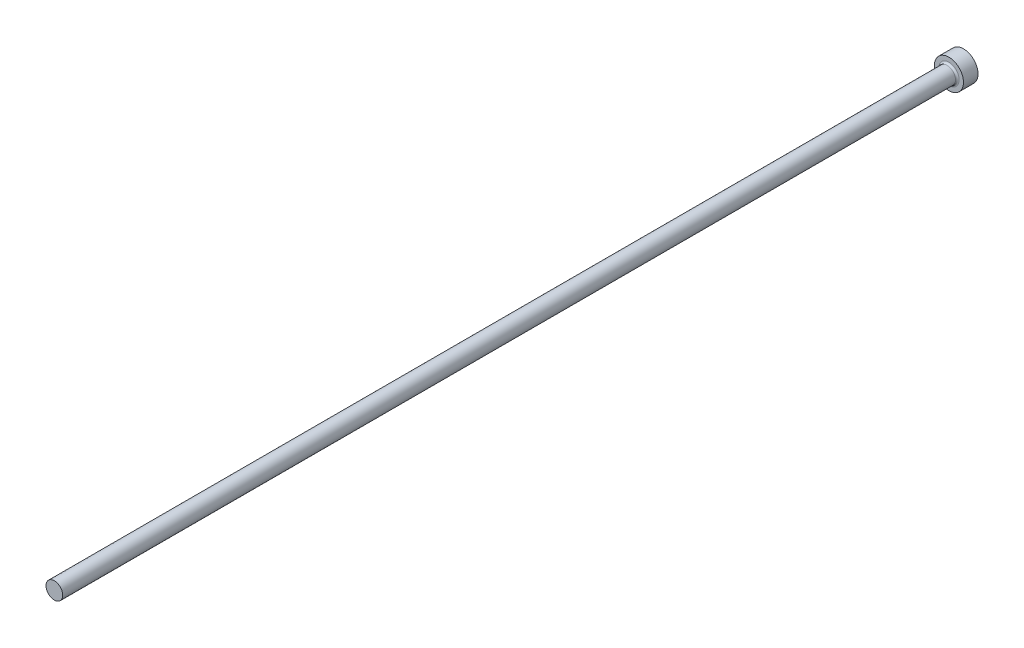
from build123d import *

# Parameters (mm, degrees)
FILLET1_R = 0.5


with BuildPart() as part:
    # FV → Revolve1 (revolve)
    with BuildSketch(Plane(origin=(0, 0, 0), x_dir=(1, 0, 0), z_dir=(0, 1, 0)), mode=Mode.PRIVATE) as revolve1_sk:
        Polygon((0, 0), (4, 0), (4, -4), (2.3, -4), (2.3, -250), (0, -250), align=None)
    revolve(revolve1_sk.sketch.rotate(Axis((0, 0, -9.033228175), (0, 0, 1)), 180), axis=Axis((0, 0, -9.033228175), (0, 0, 1)))

    # Fillet1
    fillet1_edges = [part.edges().sort_by_distance(p)[0] for p in [
        (2.3, 0, 4),
    ]]
    fillet(fillet1_edges, radius=FILLET1_R)


solid = part.part
